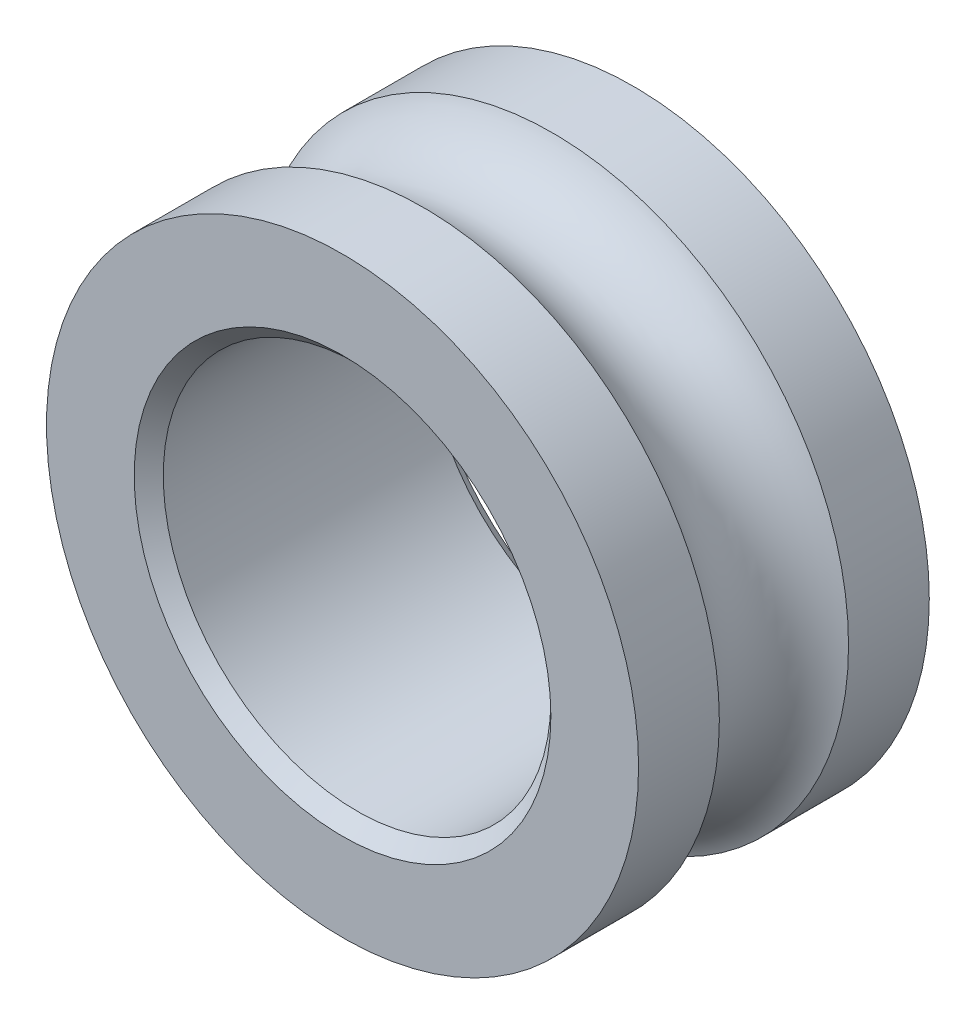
ISO-10303-21;
HEADER;
FILE_DESCRIPTION(('STEP AP214'),'2;1');
FILE_NAME('part.step','',(''),(''),'','','');
FILE_SCHEMA(('AUTOMOTIVE_DESIGN { 1 0 10303 214 1 1 1 1 }'));
ENDSEC;
DATA;
#1=APPLICATION_CONTEXT('core data for automotive mechanical design processes');
#2=APPLICATION_PROTOCOL_DEFINITION('international standard','automotive_design',2000,#1);
#3=PRODUCT_CONTEXT('',#1,'mechanical');
#4=PRODUCT('Part','Part','',(#3));
#5=PRODUCT_RELATED_PRODUCT_CATEGORY('part','',(#4));
#6=PRODUCT_DEFINITION_FORMATION('','',#4);
#7=PRODUCT_DEFINITION_CONTEXT('part definition',#1,'design');
#8=PRODUCT_DEFINITION('design','',#6,#7);
#9=PRODUCT_DEFINITION_SHAPE('','',#8);
#10=(LENGTH_UNIT() NAMED_UNIT(*) SI_UNIT(.MILLI.,.METRE.));
#11=(NAMED_UNIT(*) PLANE_ANGLE_UNIT() SI_UNIT($,.RADIAN.));
#12=(NAMED_UNIT(*) SI_UNIT($,.STERADIAN.) SOLID_ANGLE_UNIT());
#13=UNCERTAINTY_MEASURE_WITH_UNIT(LENGTH_MEASURE(1.E-05),#10,'distance_accuracy_value','');
#14=(GEOMETRIC_REPRESENTATION_CONTEXT(3) GLOBAL_UNCERTAINTY_ASSIGNED_CONTEXT((#13)) GLOBAL_UNIT_ASSIGNED_CONTEXT((#10,
#11,#12)) REPRESENTATION_CONTEXT('',''));
#15=CARTESIAN_POINT('',(0.,0.,0.));
#16=DIRECTION('',(0.,0.,1.));
#17=DIRECTION('',(1.,0.,0.));
#18=AXIS2_PLACEMENT_3D('',#15,#16,#17);
#19=CARTESIAN_POINT('',(0.,0.,0.));
#20=DIRECTION('',(0.,0.,1.));
#21=DIRECTION('',(1.,0.,0.));
#22=AXIS2_PLACEMENT_3D('',#19,#20,#21);
#23=TOROIDAL_SURFACE('',#22,7.9375,1.72035132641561);
#24=CARTESIAN_POINT('',(0.,0.,1.5875));
#25=DIRECTION('',(0.,0.,1.));
#26=DIRECTION('',(1.,0.,0.));
#27=AXIS2_PLACEMENT_3D('',#24,#25,#26);
#28=CIRCLE('',#27,7.27458791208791);
#29=CARTESIAN_POINT('',(7.27458791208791,0.,1.5875));
#30=VERTEX_POINT('',#29);
#31=EDGE_CURVE('E61',#30,#30,#28,.T.);
#32=ORIENTED_EDGE('',*,*,#31,.F.);
#33=EDGE_LOOP('',(#32));
#34=FACE_BOUND('',#33,.T.);
#35=CARTESIAN_POINT('',(0.,0.,-1.5875));
#36=DIRECTION('',(0.,0.,1.));
#37=DIRECTION('',(1.,0.,0.));
#38=AXIS2_PLACEMENT_3D('',#35,#36,#37);
#39=CIRCLE('',#38,7.27458791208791);
#40=CARTESIAN_POINT('',(7.27458791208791,0.,-1.5875));
#41=VERTEX_POINT('',#40);
#42=EDGE_CURVE('E66',#41,#41,#39,.T.);
#43=ORIENTED_EDGE('',*,*,#42,.T.);
#44=EDGE_LOOP('',(#43));
#45=FACE_BOUND('',#44,.T.);
#46=ADVANCED_FACE('F17',(#34,#45),#23,.F.);
#47=CARTESIAN_POINT('',(0.,0.,3.571875));
#48=DIRECTION('',(0.,0.,1.));
#49=DIRECTION('',(1.,0.,0.));
#50=AXIS2_PLACEMENT_3D('',#47,#48,#49);
#51=CONICAL_SURFACE('',#50,5.1196875,0.785398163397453);
#52=CARTESIAN_POINT('',(0.,0.,3.21468750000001));
#53=DIRECTION('',(0.,0.,1.));
#54=DIRECTION('',(1.,0.,0.));
#55=AXIS2_PLACEMENT_3D('',#52,#53,#54);
#56=CIRCLE('',#55,4.7625);
#57=CARTESIAN_POINT('',(4.7625,0.,3.21468750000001));
#58=VERTEX_POINT('',#57);
#59=EDGE_CURVE('E11',#58,#58,#56,.T.);
#60=ORIENTED_EDGE('',*,*,#59,.F.);
#61=EDGE_LOOP('',(#60));
#62=FACE_BOUND('',#61,.T.);
#63=CARTESIAN_POINT('',(0.,0.,3.571875));
#64=DIRECTION('',(0.,0.,1.));
#65=DIRECTION('',(1.,0.,0.));
#66=AXIS2_PLACEMENT_3D('',#63,#64,#65);
#67=CIRCLE('',#66,5.1196875);
#68=CARTESIAN_POINT('',(5.1196875,0.,3.571875));
#69=VERTEX_POINT('',#68);
#70=EDGE_CURVE('E67',#69,#69,#67,.T.);
#71=ORIENTED_EDGE('',*,*,#70,.T.);
#72=EDGE_LOOP('',(#71));
#73=FACE_BOUND('',#72,.T.);
#74=ADVANCED_FACE('F125',(#62,#73),#51,.F.);
#75=CARTESIAN_POINT('',(0.,0.,3.571875));
#76=DIRECTION('',(0.,0.,1.));
#77=DIRECTION('',(1.,0.,0.));
#78=AXIS2_PLACEMENT_3D('',#75,#76,#77);
#79=CYLINDRICAL_SURFACE('',#78,4.7625);
#80=CARTESIAN_POINT('',(0.,0.,-3.21468750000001));
#81=DIRECTION('',(0.,0.,1.));
#82=DIRECTION('',(1.,0.,0.));
#83=AXIS2_PLACEMENT_3D('',#80,#81,#82);
#84=CIRCLE('',#83,4.7625);
#85=CARTESIAN_POINT('',(4.7625,0.,-3.21468750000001));
#86=VERTEX_POINT('',#85);
#87=EDGE_CURVE('E25',#86,#86,#84,.T.);
#88=ORIENTED_EDGE('',*,*,#87,.F.);
#89=EDGE_LOOP('',(#88));
#90=FACE_BOUND('',#89,.T.);
#91=ORIENTED_EDGE('',*,*,#59,.T.);
#92=EDGE_LOOP('',(#91));
#93=FACE_BOUND('',#92,.T.);
#94=ADVANCED_FACE('F121',(#90,#93),#79,.F.);
#95=CARTESIAN_POINT('',(0.,0.,-3.21468750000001));
#96=DIRECTION('',(0.,0.,-1.));
#97=DIRECTION('',(-1.,0.,0.));
#98=AXIS2_PLACEMENT_3D('',#95,#96,#97);
#99=CONICAL_SURFACE('',#98,4.7625,0.785398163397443);
#100=ORIENTED_EDGE('',*,*,#87,.T.);
#101=EDGE_LOOP('',(#100));
#102=FACE_BOUND('',#101,.T.);
#103=CARTESIAN_POINT('',(0.,0.,-3.571875));
#104=DIRECTION('',(0.,0.,1.));
#105=DIRECTION('',(1.,0.,0.));
#106=AXIS2_PLACEMENT_3D('',#103,#104,#105);
#107=CIRCLE('',#106,5.1196875);
#108=CARTESIAN_POINT('',(5.1196875,0.,-3.571875));
#109=VERTEX_POINT('',#108);
#110=EDGE_CURVE('E152',#109,#109,#107,.T.);
#111=ORIENTED_EDGE('',*,*,#110,.F.);
#112=EDGE_LOOP('',(#111));
#113=FACE_BOUND('',#112,.T.);
#114=ADVANCED_FACE('F113',(#102,#113),#99,.F.);
#115=CARTESIAN_POINT('',(0.,0.,3.571875));
#116=DIRECTION('',(0.,0.,1.));
#117=DIRECTION('',(1.,0.,0.));
#118=AXIS2_PLACEMENT_3D('',#115,#116,#117);
#119=CYLINDRICAL_SURFACE('',#118,7.27458791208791);
#120=CARTESIAN_POINT('',(0.,0.,-3.571875));
#121=DIRECTION('',(0.,0.,1.));
#122=DIRECTION('',(1.,0.,0.));
#123=AXIS2_PLACEMENT_3D('',#120,#121,#122);
#124=CIRCLE('',#123,7.27458791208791);
#125=CARTESIAN_POINT('',(7.27458791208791,0.,-3.571875));
#126=VERTEX_POINT('',#125);
#127=EDGE_CURVE('E149',#126,#126,#124,.T.);
#128=ORIENTED_EDGE('',*,*,#127,.T.);
#129=EDGE_LOOP('',(#128));
#130=FACE_BOUND('',#129,.T.);
#131=ORIENTED_EDGE('',*,*,#42,.F.);
#132=EDGE_LOOP('',(#131));
#133=FACE_BOUND('',#132,.T.);
#134=ADVANCED_FACE('F106',(#130,#133),#119,.T.);
#135=CARTESIAN_POINT('',(0.,0.,3.571875));
#136=DIRECTION('',(0.,0.,1.));
#137=DIRECTION('',(1.,0.,0.));
#138=AXIS2_PLACEMENT_3D('',#135,#136,#137);
#139=CYLINDRICAL_SURFACE('',#138,7.27458791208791);
#140=ORIENTED_EDGE('',*,*,#31,.T.);
#141=EDGE_LOOP('',(#140));
#142=FACE_BOUND('',#141,.T.);
#143=CARTESIAN_POINT('',(0.,0.,3.571875));
#144=DIRECTION('',(0.,0.,1.));
#145=DIRECTION('',(1.,0.,0.));
#146=AXIS2_PLACEMENT_3D('',#143,#144,#145);
#147=CIRCLE('',#146,7.27458791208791);
#148=CARTESIAN_POINT('',(7.27458791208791,0.,3.571875));
#149=VERTEX_POINT('',#148);
#150=EDGE_CURVE('E74',#149,#149,#147,.T.);
#151=ORIENTED_EDGE('',*,*,#150,.F.);
#152=EDGE_LOOP('',(#151));
#153=FACE_BOUND('',#152,.T.);
#154=ADVANCED_FACE('F62',(#142,#153),#139,.T.);
#155=CARTESIAN_POINT('',(0.,7.27458791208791,3.571875));
#156=DIRECTION('',(0.,0.,-1.));
#157=DIRECTION('',(0.,-1.,0.));
#158=AXIS2_PLACEMENT_3D('',#155,#156,#157);
#159=PLANE('',#158);
#160=ORIENTED_EDGE('',*,*,#70,.F.);
#161=EDGE_LOOP('',(#160));
#162=FACE_BOUND('',#161,.T.);
#163=ORIENTED_EDGE('',*,*,#150,.T.);
#164=EDGE_LOOP('',(#163));
#165=FACE_BOUND('',#164,.T.);
#166=ADVANCED_FACE('F90',(#162,#165),#159,.F.);
#167=CARTESIAN_POINT('',(0.,5.1196875,-3.571875));
#168=DIRECTION('',(0.,0.,1.));
#169=DIRECTION('',(1.,0.,0.));
#170=AXIS2_PLACEMENT_3D('',#167,#168,#169);
#171=PLANE('',#170);
#172=ORIENTED_EDGE('',*,*,#127,.F.);
#173=EDGE_LOOP('',(#172));
#174=FACE_BOUND('',#173,.T.);
#175=ORIENTED_EDGE('',*,*,#110,.T.);
#176=EDGE_LOOP('',(#175));
#177=FACE_BOUND('',#176,.T.);
#178=ADVANCED_FACE('F85',(#174,#177),#171,.F.);
#179=CLOSED_SHELL('',(#46,#74,#94,#114,#134,#154,#166,#178));
#180=MANIFOLD_SOLID_BREP('B1',#179);
#181=ADVANCED_BREP_SHAPE_REPRESENTATION('',(#18,#180),#14);
#182=SHAPE_DEFINITION_REPRESENTATION(#9,#181);
ENDSEC;
END-ISO-10303-21;
